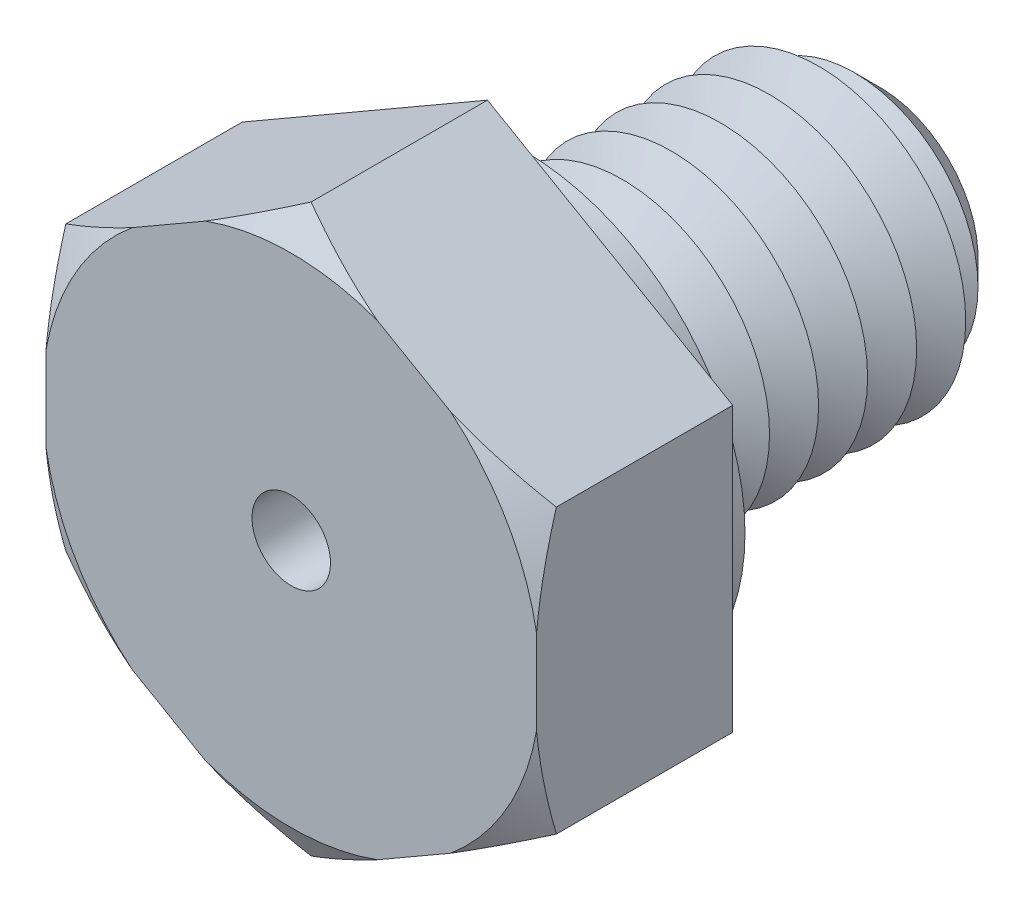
from build123d import *

# Parameters (mm, degrees)
BOSS_EXTRUDE1_DEPTH = 4
SKETCH3_R           = 3
BOSS_EXTRUDE2_DEPTH = 8
SKETCH4_R           = 4.5
BOSS_EXTRUDE3_DEPTH = 0.75
CHAMFER1_SIZE       = 1
LPATTERN1_COUNT     = 7
LPATTERN1_PITCH     = 1
SKETCH8_R           = 0.8
CUT_EXTRUDE1_DEPTH  = 12


with BuildPart() as part:
    # Sketch2 → Boss-Extrude1 (new body)
    with BuildSketch(Plane.XY):
        Polygon((0, 5.773502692), (-5, 2.886751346), (-5, -2.886751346), (0, -5.773502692), (5, -2.886751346), (5, 2.886751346), align=None)
    extrude(amount=BOSS_EXTRUDE1_DEPTH)

    # Sketch3 → Boss-Extrude2 (add)
    with BuildSketch(Plane(origin=(0, 0, 0), x_dir=(-1, 0, 0), z_dir=(0, 0, -1))):
        Circle(SKETCH3_R)
    extrude(amount=BOSS_EXTRUDE2_DEPTH)

    # Sketch4 → Boss-Extrude3 (add)
    with BuildSketch(Plane(origin=(0, 0, 0), x_dir=(-1, 0, 0), z_dir=(0, 0, -1))):
        with Locations(Location((0, 0, 0), (0, 0, 180))):
            Circle(SKETCH4_R)
    extrude(amount=BOSS_EXTRUDE3_DEPTH)

    # Chamfer1
    chamfer1_edges = [part.edges().sort_by_distance(p)[0] for p in [
        (3, 0, -8),
    ]]
    chamfer(chamfer1_edges, length=CHAMFER1_SIZE)

    # Sketch6 → Cut-Revolve1 (revolve, cut)
    with BuildSketch(Plane(origin=(0, 0, 0), x_dir=(0, 0, -1), z_dir=(1, 0, 0)), mode=Mode.PRIVATE) as cut_revolve1_sk:
        Polygon((0.75, 3), (1.25, 2.133974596), (1.75, 3), align=None)
    cut_revolve1 = revolve(cut_revolve1_sk.sketch.rotate(Axis((0, 0, 3.211670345), (0, 0, -1)), 90), axis=Axis((0, 0, 3.211670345), (0, 0, -1)), mode=Mode.SUBTRACT)

    # LPattern1: Cut-Revolve1 ×7
    with Locations(*[(0, 0, -i * LPATTERN1_PITCH) for i in range(1, LPATTERN1_COUNT)]):
        add(cut_revolve1, mode=Mode.SUBTRACT)

    # Sketch7 → Cut-Revolve2 (revolve, cut)
    with BuildSketch(Plane(origin=(0, 0, 0), x_dir=(0, 0, -1), z_dir=(1, 0, 0)), mode=Mode.PRIVATE) as cut_revolve2_sk:
        Polygon((-4, 5.773502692), (-4, 5.073502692), (-3.595854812, 5.773502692), align=None)
    revolve(cut_revolve2_sk.sketch.rotate(Axis((0, 0, 3.211670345), (0, 0, -1)), 270), axis=Axis((0, 0, 3.211670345), (0, 0, -1)), mode=Mode.SUBTRACT)

    # Sketch8 → Cut-Extrude1 (cut)
    with BuildSketch(Plane.XY.offset(4)):
        Circle(SKETCH8_R)
    extrude(amount=-CUT_EXTRUDE1_DEPTH, mode=Mode.SUBTRACT)


solid = part.part
